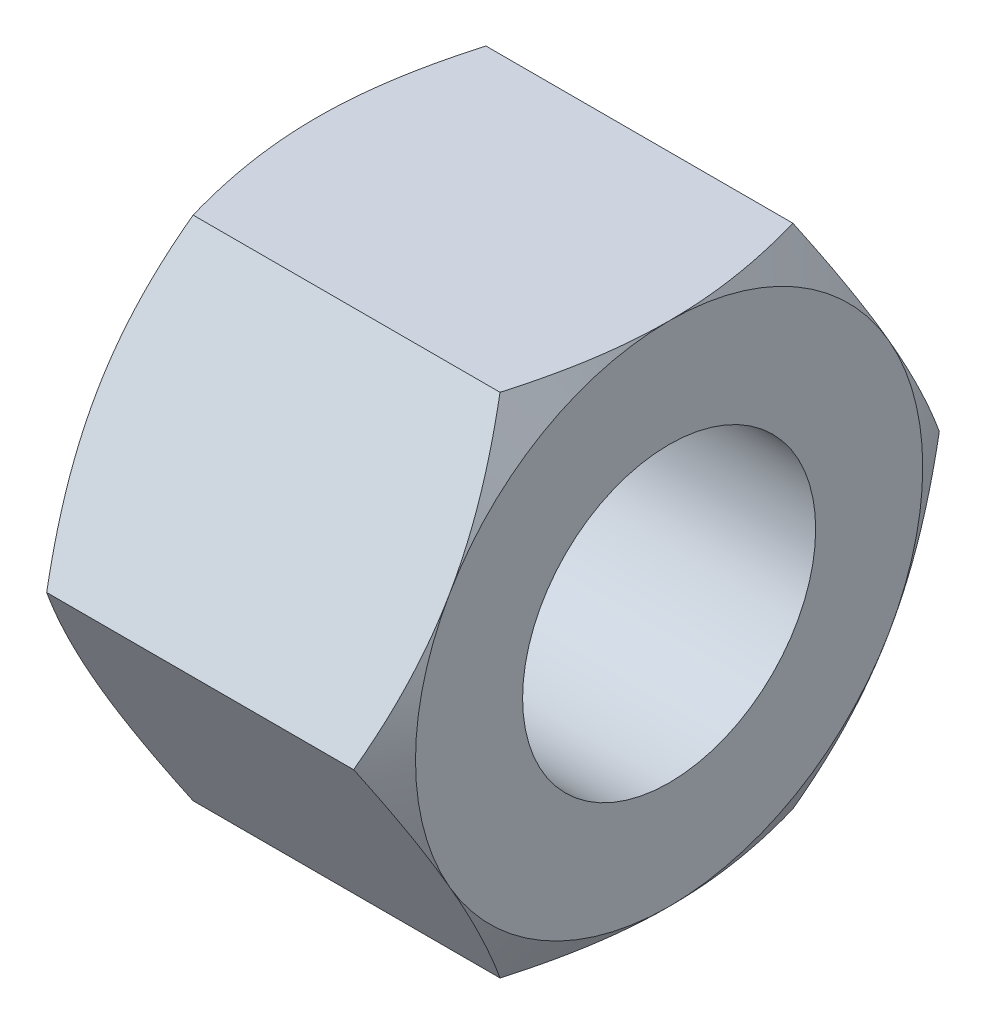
ISO-10303-21;
HEADER;
FILE_DESCRIPTION(('STEP AP214'),'2;1');
FILE_NAME('part.step','',(''),(''),'','','');
FILE_SCHEMA(('AUTOMOTIVE_DESIGN { 1 0 10303 214 1 1 1 1 }'));
ENDSEC;
DATA;
#1=APPLICATION_CONTEXT('core data for automotive mechanical design processes');
#2=APPLICATION_PROTOCOL_DEFINITION('international standard','automotive_design',2000,#1);
#3=PRODUCT_CONTEXT('',#1,'mechanical');
#4=PRODUCT('Part','Part','',(#3));
#5=PRODUCT_RELATED_PRODUCT_CATEGORY('part','',(#4));
#6=PRODUCT_DEFINITION_FORMATION('','',#4);
#7=PRODUCT_DEFINITION_CONTEXT('part definition',#1,'design');
#8=PRODUCT_DEFINITION('design','',#6,#7);
#9=PRODUCT_DEFINITION_SHAPE('','',#8);
#10=(LENGTH_UNIT() NAMED_UNIT(*) SI_UNIT(.MILLI.,.METRE.));
#11=(NAMED_UNIT(*) PLANE_ANGLE_UNIT() SI_UNIT($,.RADIAN.));
#12=(NAMED_UNIT(*) SI_UNIT($,.STERADIAN.) SOLID_ANGLE_UNIT());
#13=UNCERTAINTY_MEASURE_WITH_UNIT(LENGTH_MEASURE(1.E-05),#10,'distance_accuracy_value','');
#14=(GEOMETRIC_REPRESENTATION_CONTEXT(3) GLOBAL_UNCERTAINTY_ASSIGNED_CONTEXT((#13)) GLOBAL_UNIT_ASSIGNED_CONTEXT((#10,
#11,#12)) REPRESENTATION_CONTEXT('',''));
#15=CARTESIAN_POINT('',(0.,0.,0.));
#16=DIRECTION('',(0.,0.,1.));
#17=DIRECTION('',(1.,0.,0.));
#18=AXIS2_PLACEMENT_3D('',#15,#16,#17);
#19=CARTESIAN_POINT('',(0.,0.,0.));
#20=DIRECTION('',(-1.,0.,0.));
#21=DIRECTION('',(0.,0.,1.));
#22=AXIS2_PLACEMENT_3D('',#19,#20,#21);
#23=CONICAL_SURFACE('',#22,18.,1.0471975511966);
#24=CARTESIAN_POINT('',(-1.60776182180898,0.000199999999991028,-20.7847251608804));
#25=CARTESIAN_POINT('',(-1.47589336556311,-0.395432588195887,-20.5563065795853));
#26=CARTESIAN_POINT('',(-1.35000889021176,-0.792608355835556,-20.3269970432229));
#27=CARTESIAN_POINT('',(-1.11187123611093,-1.59014476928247,-19.8665391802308));
#28=CARTESIAN_POINT('',(-0.999622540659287,-1.99050641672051,-19.6353902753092));
#29=CARTESIAN_POINT('',(-0.790265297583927,-2.79518836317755,-19.1708069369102));
#30=CARTESIAN_POINT('',(-0.693192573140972,-3.19951570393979,-18.9373684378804));
#31=CARTESIAN_POINT('',(-0.516271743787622,-4.01097986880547,-18.4688693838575));
#32=CARTESIAN_POINT('',(-0.436422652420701,-4.41811653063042,-18.2338089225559));
#33=CARTESIAN_POINT('',(-0.297345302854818,-5.22476711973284,-17.7680889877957));
#34=CARTESIAN_POINT('',(-0.237656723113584,-5.62422116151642,-17.537464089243));
#35=CARTESIAN_POINT('',(-0.137572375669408,-6.42495960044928,-17.0751575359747));
#36=CARTESIAN_POINT('',(-0.0971769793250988,-6.82624403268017,-16.8434758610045));
#37=CARTESIAN_POINT('',(-0.0366989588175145,-7.62948698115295,-16.3797233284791));
#38=CARTESIAN_POINT('',(-0.016592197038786,-8.03144412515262,-16.1476532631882));
#39=CARTESIAN_POINT('',(0.0028761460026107,-8.83572943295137,-15.6832989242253));
#40=CARTESIAN_POINT('',(0.00223836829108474,-9.23805758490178,-15.4510146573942));
#41=CARTESIAN_POINT('',(-0.01833357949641,-9.99021934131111,-15.0167538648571));
#42=CARTESIAN_POINT('',(-0.0357591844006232,-10.3401065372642,-14.8147463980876));
#43=CARTESIAN_POINT('',(-0.0859690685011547,-11.0390463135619,-14.4112133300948));
#44=CARTESIAN_POINT('',(-0.118753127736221,-11.3880989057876,-14.209687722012));
#45=CARTESIAN_POINT('',(-0.199111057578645,-12.0852372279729,-13.8071947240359));
#46=CARTESIAN_POINT('',(-0.246698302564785,-12.4333217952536,-13.6062280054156));
#47=CARTESIAN_POINT('',(-0.355822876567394,-13.1278338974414,-13.2052512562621));
#48=CARTESIAN_POINT('',(-0.417360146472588,-13.4742614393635,-13.0052412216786));
#49=CARTESIAN_POINT('',(-0.624462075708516,-14.525886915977,-12.3980849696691));
#50=CARTESIAN_POINT('',(-0.790677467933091,-15.228039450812,-11.99269701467));
#51=CARTESIAN_POINT('',(-1.16791817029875,-16.6218747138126,-11.1879658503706));
#52=CARTESIAN_POINT('',(-1.37885488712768,-17.3135752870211,-10.78861233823));
#53=CARTESIAN_POINT('',(-1.60776182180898,-18.0002,-10.3921893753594));
#54=B_SPLINE_CURVE_WITH_KNOTS('',3,(#24,#25,#26,#27,#28,#29,#30,#31,#32,#33,#34,#35,#36,#37,#38,
#39,#40,#41,#42,#43,#44,#45,#46,#47,#48,#49,#50,#51,#52,#53),.UNSPECIFIED.,.F.,.F.,(4,2,2,2,2,2,
2,2,2,2,2,2,2,2,4),(0.,1.42650335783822,2.85347447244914,4.28376471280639,5.71397301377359,
7.10888071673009,8.50381526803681,9.89708828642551,11.2903182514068,12.5031974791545,
13.7160593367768,14.9300201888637,16.1439758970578,18.6253607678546,21.1018751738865),.UNSPECIFIED.);
#55=CARTESIAN_POINT('',(-1.60769515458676,0.,-20.7846096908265));
#56=VERTEX_POINT('',#55);
#57=CARTESIAN_POINT('',(0.,-8.99999999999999,-15.5884572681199));
#58=VERTEX_POINT('',#57);
#59=EDGE_CURVE('E360',#56,#58,#54,.T.);
#60=ORIENTED_EDGE('',*,*,#59,.F.);
#61=CARTESIAN_POINT('',(-1.60776182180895,18.0002,-10.3921893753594));
#62=CARTESIAN_POINT('',(-1.47589336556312,17.6045674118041,-10.6206079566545));
#63=CARTESIAN_POINT('',(-1.35000889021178,17.2073916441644,-10.8499174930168));
#64=CARTESIAN_POINT('',(-1.11187123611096,16.4098552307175,-11.3103753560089));
#65=CARTESIAN_POINT('',(-0.999622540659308,16.0094935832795,-11.5415242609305));
#66=CARTESIAN_POINT('',(-0.790265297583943,15.2048116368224,-12.0061075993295));
#67=CARTESIAN_POINT('',(-0.693192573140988,14.8004842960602,-12.2395460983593));
#68=CARTESIAN_POINT('',(-0.516271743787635,13.9890201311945,-12.7080451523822));
#69=CARTESIAN_POINT('',(-0.436422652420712,13.5818834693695,-12.9431056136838));
#70=CARTESIAN_POINT('',(-0.297345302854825,12.7752328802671,-13.4088255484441));
#71=CARTESIAN_POINT('',(-0.237656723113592,12.3757788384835,-13.6394504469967));
#72=CARTESIAN_POINT('',(-0.137572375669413,11.5750403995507,-14.1017570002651));
#73=CARTESIAN_POINT('',(-0.0971769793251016,11.1737559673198,-14.3334386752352));
#74=CARTESIAN_POINT('',(-0.0366989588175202,10.370513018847,-14.7971912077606));
#75=CARTESIAN_POINT('',(-0.0165921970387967,9.96855587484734,-15.0292612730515));
#76=CARTESIAN_POINT('',(0.00287614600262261,9.16427056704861,-15.4936156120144));
#77=CARTESIAN_POINT('',(0.00223836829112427,8.76194241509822,-15.7258998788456));
#78=CARTESIAN_POINT('',(-0.0183335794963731,8.00978065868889,-16.1601606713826));
#79=CARTESIAN_POINT('',(-0.0357591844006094,7.65989346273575,-16.3621681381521));
#80=CARTESIAN_POINT('',(-0.0859690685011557,6.96095368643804,-16.7657012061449));
#81=CARTESIAN_POINT('',(-0.118753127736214,6.61190109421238,-16.9672268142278));
#82=CARTESIAN_POINT('',(-0.199111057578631,5.91476277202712,-17.3697198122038));
#83=CARTESIAN_POINT('',(-0.246698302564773,5.56667820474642,-17.5706865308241));
#84=CARTESIAN_POINT('',(-0.355822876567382,4.87216610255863,-17.9716632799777));
#85=CARTESIAN_POINT('',(-0.417360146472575,4.52573856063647,-18.1716733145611));
#86=CARTESIAN_POINT('',(-0.624462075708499,3.47411308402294,-18.7788295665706));
#87=CARTESIAN_POINT('',(-0.790677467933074,2.77196054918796,-19.1842175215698));
#88=CARTESIAN_POINT('',(-1.16791817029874,1.37812528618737,-19.9889486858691));
#89=CARTESIAN_POINT('',(-1.37885488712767,0.686424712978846,-20.3883021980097));
#90=CARTESIAN_POINT('',(-1.60776182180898,-0.000200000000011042,-20.7847251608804));
#91=B_SPLINE_CURVE_WITH_KNOTS('',3,(#61,#62,#63,#64,#65,#66,#67,#68,#69,#70,#71,#72,#73,#74,#75,
#76,#77,#78,#79,#80,#81,#82,#83,#84,#85,#86,#87,#88,#89,#90),.UNSPECIFIED.,.F.,.F.,(4,2,2,2,2,2,
2,2,2,2,2,2,2,2,4),(0.,1.42650335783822,2.85347447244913,4.28376471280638,5.71397301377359,
7.10888071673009,8.50381526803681,9.8970882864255,11.2903182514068,12.5031974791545,
13.7160593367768,14.9300201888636,16.1439758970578,18.6253607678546,21.1018751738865),.UNSPECIFIED.);
#92=CARTESIAN_POINT('',(0.,9.,-15.5884572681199));
#93=VERTEX_POINT('',#92);
#94=EDGE_CURVE('E180',#93,#56,#91,.T.);
#95=ORIENTED_EDGE('',*,*,#94,.F.);
#96=CARTESIAN_POINT('',(0.,0.,0.));
#97=DIRECTION('',(-1.,0.,0.));
#98=DIRECTION('',(0.,0.,1.));
#99=AXIS2_PLACEMENT_3D('',#96,#97,#98);
#100=CIRCLE('',#99,18.);
#101=EDGE_CURVE('E305',#93,#58,#100,.T.);
#102=ORIENTED_EDGE('',*,*,#101,.T.);
#103=EDGE_LOOP('',(#60,#95,#102));
#104=FACE_BOUND('',#103,.T.);
#105=ADVANCED_FACE('F34',(#104),#23,.T.);
#106=CARTESIAN_POINT('',(-1.60769515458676,-18.,-10.3923048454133));
#107=VERTEX_POINT('',#106);
#108=EDGE_CURVE('E186',#58,#107,#54,.T.);
#109=ORIENTED_EDGE('',*,*,#108,.F.);
#110=CARTESIAN_POINT('',(0.,-18.,0.));
#111=VERTEX_POINT('',#110);
#112=EDGE_CURVE('E307',#58,#111,#100,.T.);
#113=ORIENTED_EDGE('',*,*,#112,.T.);
#114=CARTESIAN_POINT('',(-8.61350429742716,-18.,-27.5619727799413));
#115=CARTESIAN_POINT('',(-8.42250111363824,-18.,-27.1668363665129));
#116=CARTESIAN_POINT('',(-8.2324864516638,-18.,-26.7712223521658));
#117=CARTESIAN_POINT('',(-7.85466107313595,-18.,-25.9789382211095));
#118=CARTESIAN_POINT('',(-7.66685038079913,-18.,-25.5822680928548));
#119=CARTESIAN_POINT('',(-7.10701020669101,-18.,-24.3904060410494));
#120=CARTESIAN_POINT('',(-6.73863488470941,-18.,-23.5934908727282));
#121=CARTESIAN_POINT('',(-6.0118990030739,-18.,-21.9895934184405));
#122=CARTESIAN_POINT('',(-5.6536078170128,-18.,-21.1825796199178));
#123=CARTESIAN_POINT('',(-4.95240870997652,-18.,-19.5619199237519));
#124=CARTESIAN_POINT('',(-4.60949998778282,-18.,-18.7482743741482));
#125=CARTESIAN_POINT('',(-3.93909504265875,-18.,-17.1029564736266));
#126=CARTESIAN_POINT('',(-3.61183972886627,-18.,-16.2711854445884));
#127=CARTESIAN_POINT('',(-2.98295842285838,-18.,-14.5978268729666));
#128=CARTESIAN_POINT('',(-2.68133527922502,-18.,-13.7562382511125));
#129=CARTESIAN_POINT('',(-2.11182687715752,-18.,-12.0636618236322));
#130=CARTESIAN_POINT('',(-1.84386988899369,-18.,-11.2126983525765));
#131=CARTESIAN_POINT('',(-1.35038285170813,-18.,-9.49859158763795));
#132=CARTESIAN_POINT('',(-1.12483939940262,-18.,-8.63545223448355));
#133=CARTESIAN_POINT('',(-0.826590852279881,-18.,-7.33144727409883));
#134=CARTESIAN_POINT('',(-0.733837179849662,-18.,-6.8951370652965));
#135=CARTESIAN_POINT('',(-0.563150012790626,-18.,-6.01961274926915));
#136=CARTESIAN_POINT('',(-0.485216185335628,-18.,-5.58039870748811));
#137=CARTESIAN_POINT('',(-0.345550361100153,-18.,-4.69936149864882));
#138=CARTESIAN_POINT('',(-0.283819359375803,-18.,-4.25753817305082));
#139=CARTESIAN_POINT('',(-0.177799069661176,-18.,-3.37178866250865));
#140=CARTESIAN_POINT('',(-0.133509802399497,-18.,-2.92786247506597));
#141=CARTESIAN_POINT('',(-0.0635653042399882,-18.,-2.0413727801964));
#142=CARTESIAN_POINT('',(-0.0377934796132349,-18.,-1.5988185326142));
#143=CARTESIAN_POINT('',(-0.00501935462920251,-18.,-0.713017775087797));
#144=CARTESIAN_POINT('',(0.00198322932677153,-18.,-0.269771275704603));
#145=CARTESIAN_POINT('',(-0.00294720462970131,-18.,0.616495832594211));
#146=CARTESIAN_POINT('',(-0.0148749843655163,-18.,1.05951647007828));
#147=CARTESIAN_POINT('',(-0.0573695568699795,-18.,1.94466484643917));
#148=CARTESIAN_POINT('',(-0.0879371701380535,-18.,2.38679254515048));
#149=CARTESIAN_POINT('',(-0.183946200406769,-18.,3.45804884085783));
#150=CARTESIAN_POINT('',(-0.258707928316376,-18.,4.08635840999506));
#151=CARTESIAN_POINT('',(-0.441712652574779,-18.,5.33805549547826));
#152=CARTESIAN_POINT('',(-0.549960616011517,-18.,5.96144226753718));
#153=CARTESIAN_POINT('',(-0.919504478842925,-18.,7.82530592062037));
#154=CARTESIAN_POINT('',(-1.22535434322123,-18.,9.05705135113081));
#155=CARTESIAN_POINT('',(-1.75274123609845,-18.,10.8995368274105));
#156=CARTESIAN_POINT('',(-1.9425529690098,-18.,11.5199034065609));
#157=CARTESIAN_POINT('',(-2.34110156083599,-18.,12.7546432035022));
#158=CARTESIAN_POINT('',(-2.54984012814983,-18.,13.3690158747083));
#159=CARTESIAN_POINT('',(-2.98179468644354,-18.,14.5887054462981));
#160=CARTESIAN_POINT('',(-3.20492239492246,-18.,15.1940538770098));
#161=CARTESIAN_POINT('',(-3.54927449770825,-18.,16.0982639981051));
#162=CARTESIAN_POINT('',(-3.66564891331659,-18.,16.3989833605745));
#163=CARTESIAN_POINT('',(-3.90135657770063,-18.,16.9992538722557));
#164=CARTESIAN_POINT('',(-4.02068976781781,-18.,17.298805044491));
#165=CARTESIAN_POINT('',(-4.1413688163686,-18.,17.5978126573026));
#166=B_SPLINE_CURVE_WITH_KNOTS('',3,(#114,#115,#116,#117,#118,#119,#120,#121,#122,#123,#124,
#125,#126,#127,#128,#129,#130,#131,#132,#133,#134,#135,#136,#137,#138,#139,#140,#141,#142,#143,
#144,#145,#146,#147,#148,#149,#150,#151,#152,#153,#154,#155,#156,#157,#158,#159,#160,#161,#162,
#163,#164,#165),.UNSPECIFIED.,.F.,.F.,(4,2,2,2,2,2,2,2,2,2,2,2,2,2,2,2,2,2,2,2,2,2,2,2,2,4),(0.,
1.31663520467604,2.63328486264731,5.26701230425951,7.91581142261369,10.5644724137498,
13.2456515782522,15.9271283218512,18.6027913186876,21.277607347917,22.6155772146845,
23.9535170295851,25.2915389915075,26.629562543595,27.9590856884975,29.2885887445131,
30.6177239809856,31.9469177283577,33.8440654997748,35.7414948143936,39.5436623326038,
41.4897749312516,43.4360633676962,45.3713759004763,46.3387176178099,47.306040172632),.UNSPECIFIED.);
#167=EDGE_CURVE('E199',#107,#111,#166,.T.);
#168=ORIENTED_EDGE('',*,*,#167,.F.);
#169=EDGE_LOOP('',(#109,#113,#168));
#170=FACE_BOUND('',#169,.T.);
#171=ADVANCED_FACE('F165',(#170),#23,.T.);
#172=CARTESIAN_POINT('',(-1.60769515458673,-18.,10.3923048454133));
#173=VERTEX_POINT('',#172);
#174=EDGE_CURVE('E193',#111,#173,#166,.T.);
#175=ORIENTED_EDGE('',*,*,#174,.F.);
#176=CARTESIAN_POINT('',(0.,-8.99999999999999,15.5884572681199));
#177=VERTEX_POINT('',#176);
#178=EDGE_CURVE('E310',#111,#177,#100,.T.);
#179=ORIENTED_EDGE('',*,*,#178,.T.);
#180=CARTESIAN_POINT('',(-1.60776182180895,-18.0002,10.3921893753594));
#181=CARTESIAN_POINT('',(-1.47589336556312,-17.6045674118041,10.6206079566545));
#182=CARTESIAN_POINT('',(-1.35000889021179,-17.2073916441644,10.8499174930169));
#183=CARTESIAN_POINT('',(-1.11187123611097,-16.4098552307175,11.310375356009));
#184=CARTESIAN_POINT('',(-0.999622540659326,-16.0094935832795,11.5415242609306));
#185=CARTESIAN_POINT('',(-0.790265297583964,-15.2048116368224,12.0061075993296));
#186=CARTESIAN_POINT('',(-0.693192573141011,-14.8004842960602,12.2395460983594));
#187=CARTESIAN_POINT('',(-0.516271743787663,-13.9890201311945,12.7080451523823));
#188=CARTESIAN_POINT('',(-0.436422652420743,-13.5818834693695,12.9431056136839));
#189=CARTESIAN_POINT('',(-0.297345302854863,-12.7752328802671,13.4088255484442));
#190=CARTESIAN_POINT('',(-0.237656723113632,-12.3757788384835,13.6394504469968));
#191=CARTESIAN_POINT('',(-0.137572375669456,-11.5750403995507,14.1017570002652));
#192=CARTESIAN_POINT('',(-0.0971769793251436,-11.1737559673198,14.3334386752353));
#193=CARTESIAN_POINT('',(-0.0366989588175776,-10.370513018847,14.7971912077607));
#194=CARTESIAN_POINT('',(-0.0165921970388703,-9.96855587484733,15.0292612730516));
#195=CARTESIAN_POINT('',(0.00287614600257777,-9.16427056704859,15.4936156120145));
#196=CARTESIAN_POINT('',(0.00223836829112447,-8.7619424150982,15.7258998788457));
#197=CARTESIAN_POINT('',(-0.0183335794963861,-8.00978065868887,16.1601606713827));
#198=CARTESIAN_POINT('',(-0.0357591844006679,-7.65989346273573,16.3621681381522));
#199=CARTESIAN_POINT('',(-0.0859690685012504,-6.96095368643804,16.765701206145));
#200=CARTESIAN_POINT('',(-0.118753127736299,-6.61190109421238,16.9672268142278));
#201=CARTESIAN_POINT('',(-0.199111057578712,-5.91476277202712,17.3697198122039));
#202=CARTESIAN_POINT('',(-0.246698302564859,-5.56667820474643,17.5706865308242));
#203=CARTESIAN_POINT('',(-0.355822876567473,-4.87216610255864,17.9716632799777));
#204=CARTESIAN_POINT('',(-0.417360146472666,-4.52573856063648,18.1716733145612));
#205=CARTESIAN_POINT('',(-0.624462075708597,-3.47411308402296,18.7788295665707));
#206=CARTESIAN_POINT('',(-0.790677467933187,-2.77196054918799,19.1842175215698));
#207=CARTESIAN_POINT('',(-1.16791817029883,-1.37812528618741,19.9889486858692));
#208=CARTESIAN_POINT('',(-1.37885488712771,-0.686424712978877,20.3883021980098));
#209=CARTESIAN_POINT('',(-1.60776182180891,0.000199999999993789,20.7847251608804));
#210=B_SPLINE_CURVE_WITH_KNOTS('',3,(#180,#181,#182,#183,#184,#185,#186,#187,#188,#189,#190,
#191,#192,#193,#194,#195,#196,#197,#198,#199,#200,#201,#202,#203,#204,#205,#206,#207,#208,#209),
.UNSPECIFIED.,.F.,.F.,(4,2,2,2,2,2,2,2,2,2,2,2,2,2,4),(0.,1.42650335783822,2.85347447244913,
4.28376471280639,5.71397301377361,7.10888071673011,8.50381526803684,9.89708828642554,
11.2903182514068,12.5031974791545,13.7160593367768,14.9300201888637,16.1439758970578,
18.6253607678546,21.1018751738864),.UNSPECIFIED.);
#211=EDGE_CURVE('E267',#173,#177,#210,.T.);
#212=ORIENTED_EDGE('',*,*,#211,.F.);
#213=EDGE_LOOP('',(#175,#179,#212));
#214=FACE_BOUND('',#213,.T.);
#215=ADVANCED_FACE('F339',(#214),#23,.T.);
#216=CARTESIAN_POINT('',(-1.60769515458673,18.,-10.3923048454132));
#217=VERTEX_POINT('',#216);
#218=EDGE_CURVE('E228',#217,#93,#91,.T.);
#219=ORIENTED_EDGE('',*,*,#218,.F.);
#220=CARTESIAN_POINT('',(-8.61350429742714,18.,-27.5619727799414));
#221=CARTESIAN_POINT('',(-8.42250111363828,18.,-27.166836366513));
#222=CARTESIAN_POINT('',(-8.23248645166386,18.,-26.7712223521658));
#223=CARTESIAN_POINT('',(-7.85466107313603,18.,-25.9789382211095));
#224=CARTESIAN_POINT('',(-7.66685038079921,18.,-25.5822680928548));
#225=CARTESIAN_POINT('',(-7.10701020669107,18.,-24.3904060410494));
#226=CARTESIAN_POINT('',(-6.73863488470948,18.,-23.5934908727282));
#227=CARTESIAN_POINT('',(-6.01189900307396,18.,-21.9895934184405));
#228=CARTESIAN_POINT('',(-5.65360781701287,18.,-21.1825796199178));
#229=CARTESIAN_POINT('',(-4.95240870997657,18.,-19.5619199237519));
#230=CARTESIAN_POINT('',(-4.60949998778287,18.,-18.7482743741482));
#231=CARTESIAN_POINT('',(-3.9390950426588,18.,-17.1029564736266));
#232=CARTESIAN_POINT('',(-3.61183972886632,18.,-16.2711854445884));
#233=CARTESIAN_POINT('',(-2.98295842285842,18.,-14.5978268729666));
#234=CARTESIAN_POINT('',(-2.68133527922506,18.,-13.7562382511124));
#235=CARTESIAN_POINT('',(-2.11182687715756,18.,-12.0636618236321));
#236=CARTESIAN_POINT('',(-1.84386988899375,18.,-11.2126983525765));
#237=CARTESIAN_POINT('',(-1.35038285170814,18.,-9.4985915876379));
#238=CARTESIAN_POINT('',(-1.12483939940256,18.,-8.63545223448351));
#239=CARTESIAN_POINT('',(-0.826590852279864,18.,-7.33144727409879));
#240=CARTESIAN_POINT('',(-0.733837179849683,18.,-6.89513706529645));
#241=CARTESIAN_POINT('',(-0.563150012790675,18.,-6.01961274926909));
#242=CARTESIAN_POINT('',(-0.485216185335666,18.,-5.58039870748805));
#243=CARTESIAN_POINT('',(-0.345550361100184,18.,-4.69936149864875));
#244=CARTESIAN_POINT('',(-0.283819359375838,18.,-4.25753817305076));
#245=CARTESIAN_POINT('',(-0.177799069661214,18.,-3.37178866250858));
#246=CARTESIAN_POINT('',(-0.133509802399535,18.,-2.9278624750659));
#247=CARTESIAN_POINT('',(-0.0635653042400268,18.,-2.04137278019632));
#248=CARTESIAN_POINT('',(-0.0377934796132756,18.,-1.59881853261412));
#249=CARTESIAN_POINT('',(-0.00501935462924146,18.,-0.713017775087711));
#250=CARTESIAN_POINT('',(0.00198322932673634,18.,-0.269771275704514));
#251=CARTESIAN_POINT('',(-0.00294720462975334,18.,0.616495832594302));
#252=CARTESIAN_POINT('',(-0.0148749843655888,18.,1.05951647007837));
#253=CARTESIAN_POINT('',(-0.0573695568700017,18.,1.94466484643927));
#254=CARTESIAN_POINT('',(-0.0879371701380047,18.,2.38679254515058));
#255=CARTESIAN_POINT('',(-0.183946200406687,18.,3.45804884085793));
#256=CARTESIAN_POINT('',(-0.258707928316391,18.,4.08635840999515));
#257=CARTESIAN_POINT('',(-0.441712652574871,18.,5.33805549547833));
#258=CARTESIAN_POINT('',(-0.549960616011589,18.,5.96144226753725));
#259=CARTESIAN_POINT('',(-0.919504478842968,18.,7.82530592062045));
#260=CARTESIAN_POINT('',(-1.2253543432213,18.,9.05705135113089));
#261=CARTESIAN_POINT('',(-1.75274123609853,18.,10.8995368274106));
#262=CARTESIAN_POINT('',(-1.94255296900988,18.,11.519903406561));
#263=CARTESIAN_POINT('',(-2.34110156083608,18.,12.7546432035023));
#264=CARTESIAN_POINT('',(-2.54984012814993,18.,13.3690158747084));
#265=CARTESIAN_POINT('',(-2.98179468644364,18.,14.5887054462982));
#266=CARTESIAN_POINT('',(-3.20492239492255,18.,15.1940538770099));
#267=CARTESIAN_POINT('',(-3.54927449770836,18.,16.0982639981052));
#268=CARTESIAN_POINT('',(-3.66564891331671,18.,16.3989833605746));
#269=CARTESIAN_POINT('',(-3.90135657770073,18.,16.9992538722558));
#270=CARTESIAN_POINT('',(-4.02068976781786,18.,17.2988050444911));
#271=CARTESIAN_POINT('',(-4.14136881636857,18.,17.5978126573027));
#272=B_SPLINE_CURVE_WITH_KNOTS('',3,(#220,#221,#222,#223,#224,#225,#226,#227,#228,#229,#230,
#231,#232,#233,#234,#235,#236,#237,#238,#239,#240,#241,#242,#243,#244,#245,#246,#247,#248,#249,
#250,#251,#252,#253,#254,#255,#256,#257,#258,#259,#260,#261,#262,#263,#264,#265,#266,#267,#268,
#269,#270,#271),.UNSPECIFIED.,.F.,.F.,(4,2,2,2,2,2,2,2,2,2,2,2,2,2,2,2,2,2,2,2,2,2,2,2,2,4),(0.,
1.31663520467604,2.63328486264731,5.26701230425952,7.91581142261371,10.5644724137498,
13.2456515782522,15.9271283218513,18.6027913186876,21.277607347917,22.6155772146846,
23.9535170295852,25.2915389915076,26.629562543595,27.9590856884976,29.2885887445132,
30.6177239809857,31.9469177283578,33.8440654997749,35.7414948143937,39.5436623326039,
41.4897749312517,43.4360633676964,45.3713759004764,46.33871761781,47.3060401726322),.UNSPECIFIED.);
#273=CARTESIAN_POINT('',(0.,18.,0.));
#274=VERTEX_POINT('',#273);
#275=EDGE_CURVE('E142',#274,#217,#272,.F.);
#276=ORIENTED_EDGE('',*,*,#275,.F.);
#277=EDGE_CURVE('E42',#274,#93,#100,.T.);
#278=ORIENTED_EDGE('',*,*,#277,.T.);
#279=EDGE_LOOP('',(#219,#276,#278));
#280=FACE_BOUND('',#279,.T.);
#281=ADVANCED_FACE('F337',(#280),#23,.T.);
#282=CARTESIAN_POINT('',(-1.6076951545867,0.,20.7846096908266));
#283=VERTEX_POINT('',#282);
#284=EDGE_CURVE('E268',#177,#283,#210,.T.);
#285=ORIENTED_EDGE('',*,*,#284,.F.);
#286=CARTESIAN_POINT('',(0.,9.00000000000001,15.58845726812));
#287=VERTEX_POINT('',#286);
#288=EDGE_CURVE('E43',#177,#287,#100,.T.);
#289=ORIENTED_EDGE('',*,*,#288,.T.);
#290=CARTESIAN_POINT('',(-1.60776182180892,-0.000200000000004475,20.7847251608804));
#291=CARTESIAN_POINT('',(-1.47589336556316,0.395432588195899,20.5563065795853));
#292=CARTESIAN_POINT('',(-1.35000889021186,0.792608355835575,20.326997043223));
#293=CARTESIAN_POINT('',(-1.11187123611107,1.59014476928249,19.8665391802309));
#294=CARTESIAN_POINT('',(-0.999622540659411,1.99050641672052,19.6353902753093));
#295=CARTESIAN_POINT('',(-0.790265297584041,2.79518836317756,19.1708069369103));
#296=CARTESIAN_POINT('',(-0.693192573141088,3.1995157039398,18.9373684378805));
#297=CARTESIAN_POINT('',(-0.516271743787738,4.01097986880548,18.4688693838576));
#298=CARTESIAN_POINT('',(-0.436422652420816,4.41811653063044,18.233808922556));
#299=CARTESIAN_POINT('',(-0.297345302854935,5.22476711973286,17.7680889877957));
#300=CARTESIAN_POINT('',(-0.237656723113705,5.62422116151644,17.5374640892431));
#301=CARTESIAN_POINT('',(-0.137572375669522,6.42495960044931,17.0751575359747));
#302=CARTESIAN_POINT('',(-0.0971769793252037,6.82624403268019,16.8434758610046));
#303=CARTESIAN_POINT('',(-0.0366989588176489,7.62948698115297,16.3797233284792));
#304=CARTESIAN_POINT('',(-0.0165921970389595,8.03144412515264,16.1476532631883));
#305=CARTESIAN_POINT('',(0.00287614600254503,8.83572943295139,15.6832989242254));
#306=CARTESIAN_POINT('',(0.00223836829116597,9.2380575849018,15.4510146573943));
#307=CARTESIAN_POINT('',(-0.0183335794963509,9.99021934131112,15.0167538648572));
#308=CARTESIAN_POINT('',(-0.0357591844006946,10.3401065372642,14.8147463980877));
#309=CARTESIAN_POINT('',(-0.0859690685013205,11.0390463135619,14.4112133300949));
#310=CARTESIAN_POINT('',(-0.118753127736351,11.3880989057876,14.2096877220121));
#311=CARTESIAN_POINT('',(-0.199111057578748,12.0852372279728,13.807194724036));
#312=CARTESIAN_POINT('',(-0.246698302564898,12.4333217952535,13.6062280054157));
#313=CARTESIAN_POINT('',(-0.355822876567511,13.1278338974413,13.2052512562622));
#314=CARTESIAN_POINT('',(-0.4173601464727,13.4742614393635,13.0052412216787));
#315=CARTESIAN_POINT('',(-0.624462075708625,14.525886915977,12.3980849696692));
#316=CARTESIAN_POINT('',(-0.790677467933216,15.228039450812,11.9926970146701));
#317=CARTESIAN_POINT('',(-1.16791817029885,16.6218747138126,11.1879658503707));
#318=CARTESIAN_POINT('',(-1.37885488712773,17.3135752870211,10.7886123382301));
#319=CARTESIAN_POINT('',(-1.60776182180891,18.0002,10.3921893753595));
#320=B_SPLINE_CURVE_WITH_KNOTS('',3,(#290,#291,#292,#293,#294,#295,#296,#297,#298,#299,#300,
#301,#302,#303,#304,#305,#306,#307,#308,#309,#310,#311,#312,#313,#314,#315,#316,#317,#318,#319),
.UNSPECIFIED.,.F.,.F.,(4,2,2,2,2,2,2,2,2,2,2,2,2,2,4),(0.,1.4265033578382,2.85347447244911,
4.28376471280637,5.71397301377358,7.10888071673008,8.50381526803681,9.89708828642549,
11.2903182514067,12.5031974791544,13.7160593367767,14.9300201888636,16.1439758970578,
18.6253607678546,21.1018751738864),.UNSPECIFIED.);
#321=EDGE_CURVE('E50',#283,#287,#320,.T.);
#322=ORIENTED_EDGE('',*,*,#321,.F.);
#323=EDGE_LOOP('',(#285,#289,#322));
#324=FACE_BOUND('',#323,.T.);
#325=ADVANCED_FACE('F319',(#324),#23,.T.);
#326=CARTESIAN_POINT('',(-1.60769515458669,18.,10.3923048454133));
#327=VERTEX_POINT('',#326);
#328=EDGE_CURVE('E132',#327,#274,#272,.F.);
#329=ORIENTED_EDGE('',*,*,#328,.F.);
#330=EDGE_CURVE('E122',#287,#327,#320,.T.);
#331=ORIENTED_EDGE('',*,*,#330,.F.);
#332=EDGE_CURVE('E13',#287,#274,#100,.T.);
#333=ORIENTED_EDGE('',*,*,#332,.T.);
#334=EDGE_LOOP('',(#329,#331,#333));
#335=FACE_BOUND('',#334,.T.);
#336=ADVANCED_FACE('F139',(#335),#23,.T.);
#337=CARTESIAN_POINT('',(-23.3919528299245,0.,0.));
#338=DIRECTION('',(1.,0.,0.));
#339=DIRECTION('',(0.,0.,-1.));
#340=AXIS2_PLACEMENT_3D('',#337,#338,#339);
#341=CONICAL_SURFACE('',#340,20.7852193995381,1.04719755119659);
#342=CARTESIAN_POINT('',(-23.392238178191,0.000199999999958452,20.7847251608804));
#343=CARTESIAN_POINT('',(-23.5241066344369,-0.395432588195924,20.5563065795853));
#344=CARTESIAN_POINT('',(-23.6499911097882,-0.792608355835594,20.3269970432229));
#345=CARTESIAN_POINT('',(-23.888128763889,-1.5901447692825,19.8665391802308));
#346=CARTESIAN_POINT('',(-24.0003774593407,-1.99050641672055,19.6353902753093));
#347=CARTESIAN_POINT('',(-24.209734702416,-2.79518836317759,19.1708069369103));
#348=CARTESIAN_POINT('',(-24.306807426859,-3.19951570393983,18.9373684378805));
#349=CARTESIAN_POINT('',(-24.4837282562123,-4.01097986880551,18.4688693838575));
#350=CARTESIAN_POINT('',(-24.5635773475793,-4.41811653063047,18.2338089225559));
#351=CARTESIAN_POINT('',(-24.7026546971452,-5.22476711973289,17.7680889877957));
#352=CARTESIAN_POINT('',(-24.7623432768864,-5.62422116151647,17.537464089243));
#353=CARTESIAN_POINT('',(-24.8624276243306,-6.42495960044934,17.0751575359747));
#354=CARTESIAN_POINT('',(-24.9028230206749,-6.82624403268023,16.8434758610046));
#355=CARTESIAN_POINT('',(-24.9633010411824,-7.62948698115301,16.3797233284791));
#356=CARTESIAN_POINT('',(-24.9834078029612,-8.03144412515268,16.1476532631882));
#357=CARTESIAN_POINT('',(-25.0028761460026,-8.83572943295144,15.6832989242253));
#358=CARTESIAN_POINT('',(-25.0022383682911,-9.23805758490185,15.4510146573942));
#359=CARTESIAN_POINT('',(-24.9816664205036,-9.99021934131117,15.0167538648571));
#360=CARTESIAN_POINT('',(-24.9642408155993,-10.3401065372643,14.8147463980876));
#361=CARTESIAN_POINT('',(-24.9140309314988,-11.039046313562,14.4112133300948));
#362=CARTESIAN_POINT('',(-24.8812468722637,-11.3880989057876,14.209687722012));
#363=CARTESIAN_POINT('',(-24.8008889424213,-12.0852372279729,13.8071947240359));
#364=CARTESIAN_POINT('',(-24.7533016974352,-12.4333217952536,13.6062280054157));
#365=CARTESIAN_POINT('',(-24.6441771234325,-13.1278338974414,13.2052512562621));
#366=CARTESIAN_POINT('',(-24.5826398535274,-13.4742614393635,13.0052412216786));
#367=CARTESIAN_POINT('',(-24.3755379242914,-14.5258869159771,12.3980849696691));
#368=CARTESIAN_POINT('',(-24.2093225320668,-15.228039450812,11.99269701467));
#369=CARTESIAN_POINT('',(-23.8320818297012,-16.6218747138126,11.1879658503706));
#370=CARTESIAN_POINT('',(-23.6211451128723,-17.3135752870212,10.78861233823));
#371=CARTESIAN_POINT('',(-23.392238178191,-18.0002,10.3921893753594));
#372=B_SPLINE_CURVE_WITH_KNOTS('',3,(#342,#343,#344,#345,#346,#347,#348,#349,#350,#351,#352,
#353,#354,#355,#356,#357,#358,#359,#360,#361,#362,#363,#364,#365,#366,#367,#368,#369,#370,#371),
.UNSPECIFIED.,.F.,.F.,(4,2,2,2,2,2,2,2,2,2,2,2,2,2,4),(0.,1.42650335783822,2.85347447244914,
4.28376471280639,5.71397301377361,7.10888071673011,8.50381526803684,9.89708828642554,
11.2903182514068,12.5031974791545,13.7160593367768,14.9300201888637,16.1439758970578,
18.6253607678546,21.1018751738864),.UNSPECIFIED.);
#373=CARTESIAN_POINT('',(-23.3923048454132,0.,20.7846096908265));
#374=VERTEX_POINT('',#373);
#375=CARTESIAN_POINT('',(-25.,-9.00000000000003,15.5884572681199));
#376=VERTEX_POINT('',#375);
#377=EDGE_CURVE('E272',#374,#376,#372,.T.);
#378=ORIENTED_EDGE('',*,*,#377,.F.);
#379=CARTESIAN_POINT('',(-23.392238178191,18.0002,10.3921893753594));
#380=CARTESIAN_POINT('',(-23.5241066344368,17.6045674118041,10.6206079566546));
#381=CARTESIAN_POINT('',(-23.6499911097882,17.2073916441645,10.849917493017));
#382=CARTESIAN_POINT('',(-23.888128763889,16.4098552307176,11.3103753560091));
#383=CARTESIAN_POINT('',(-24.0003774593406,16.0094935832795,11.5415242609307));
#384=CARTESIAN_POINT('',(-24.209734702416,15.2048116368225,12.0061075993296));
#385=CARTESIAN_POINT('',(-24.3068074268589,14.8004842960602,12.2395460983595));
#386=CARTESIAN_POINT('',(-24.4837282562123,13.9890201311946,12.7080451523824));
#387=CARTESIAN_POINT('',(-24.5635773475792,13.5818834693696,12.943105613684));
#388=CARTESIAN_POINT('',(-24.7026546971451,12.7752328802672,13.4088255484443));
#389=CARTESIAN_POINT('',(-24.7623432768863,12.3757788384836,13.6394504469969));
#390=CARTESIAN_POINT('',(-24.8624276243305,11.5750403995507,14.1017570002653));
#391=CARTESIAN_POINT('',(-24.9028230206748,11.1737559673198,14.3334386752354));
#392=CARTESIAN_POINT('',(-24.9633010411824,10.3705130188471,14.7971912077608));
#393=CARTESIAN_POINT('',(-24.9834078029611,9.96855587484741,15.0292612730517));
#394=CARTESIAN_POINT('',(-25.0028761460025,9.16427056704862,15.4936156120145));
#395=CARTESIAN_POINT('',(-25.0022383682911,8.76194241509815,15.7258998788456));
#396=CARTESIAN_POINT('',(-24.9816664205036,8.00978065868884,16.1601606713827));
#397=CARTESIAN_POINT('',(-24.9642408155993,7.65989346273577,16.3621681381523));
#398=CARTESIAN_POINT('',(-24.9140309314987,6.96095368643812,16.7657012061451));
#399=CARTESIAN_POINT('',(-24.8812468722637,6.61190109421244,16.9672268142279));
#400=CARTESIAN_POINT('',(-24.8008889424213,5.91476277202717,17.369719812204));
#401=CARTESIAN_POINT('',(-24.7533016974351,5.56667820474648,17.5706865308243));
#402=CARTESIAN_POINT('',(-24.6441771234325,4.87216610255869,17.9716632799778));
#403=CARTESIAN_POINT('',(-24.5826398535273,4.52573856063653,18.1716733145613));
#404=CARTESIAN_POINT('',(-24.3755379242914,3.47411308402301,18.7788295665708));
#405=CARTESIAN_POINT('',(-24.2093225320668,2.77196054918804,19.1842175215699));
#406=CARTESIAN_POINT('',(-23.8320818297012,1.37812528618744,19.9889486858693));
#407=CARTESIAN_POINT('',(-23.6211451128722,0.686424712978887,20.3883021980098));
#408=CARTESIAN_POINT('',(-23.392238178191,-0.000200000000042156,20.7847251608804));
#409=B_SPLINE_CURVE_WITH_KNOTS('',3,(#379,#380,#381,#382,#383,#384,#385,#386,#387,#388,#389,
#390,#391,#392,#393,#394,#395,#396,#397,#398,#399,#400,#401,#402,#403,#404,#405,#406,#407,#408),
.UNSPECIFIED.,.F.,.F.,(4,2,2,2,2,2,2,2,2,2,2,2,2,2,4),(0.,1.42650335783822,2.85347447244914,
4.28376471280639,5.7139730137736,7.1088807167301,8.50381526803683,9.89708828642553,
11.2903182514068,12.5031974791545,13.7160593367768,14.9300201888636,16.1439758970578,
18.6253607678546,21.1018751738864),.UNSPECIFIED.);
#410=CARTESIAN_POINT('',(-25.,8.99999999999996,15.5884572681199));
#411=VERTEX_POINT('',#410);
#412=EDGE_CURVE('E323',#411,#374,#409,.T.);
#413=ORIENTED_EDGE('',*,*,#412,.F.);
#414=CARTESIAN_POINT('',(-25.,0.,0.));
#415=DIRECTION('',(-1.,0.,0.));
#416=DIRECTION('',(0.,0.,1.));
#417=AXIS2_PLACEMENT_3D('',#414,#415,#416);
#418=CIRCLE('',#417,18.);
#419=EDGE_CURVE('E260',#376,#411,#418,.T.);
#420=ORIENTED_EDGE('',*,*,#419,.F.);
#421=EDGE_LOOP('',(#378,#413,#420));
#422=FACE_BOUND('',#421,.T.);
#423=ADVANCED_FACE('F167',(#422),#341,.T.);
#424=CARTESIAN_POINT('',(-23.3923048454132,-18.,10.3923048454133));
#425=VERTEX_POINT('',#424);
#426=EDGE_CURVE('E205',#376,#425,#372,.T.);
#427=ORIENTED_EDGE('',*,*,#426,.F.);
#428=CARTESIAN_POINT('',(-25.,-18.0000000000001,0.));
#429=VERTEX_POINT('',#428);
#430=EDGE_CURVE('E354',#429,#376,#418,.T.);
#431=ORIENTED_EDGE('',*,*,#430,.F.);
#432=CARTESIAN_POINT('',(-16.3864957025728,-18.,-27.5619727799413));
#433=CARTESIAN_POINT('',(-16.5774988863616,-18.,-27.1668363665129));
#434=CARTESIAN_POINT('',(-16.767513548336,-18.,-26.7712223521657));
#435=CARTESIAN_POINT('',(-17.1453389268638,-18.,-25.9789382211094));
#436=CARTESIAN_POINT('',(-17.3331496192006,-18.,-25.5822680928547));
#437=CARTESIAN_POINT('',(-17.8929897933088,-18.,-24.3904060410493));
#438=CARTESIAN_POINT('',(-18.2613651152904,-18.,-23.5934908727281));
#439=CARTESIAN_POINT('',(-18.9881009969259,-18.,-21.9895934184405));
#440=CARTESIAN_POINT('',(-19.346392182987,-18.,-21.1825796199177));
#441=CARTESIAN_POINT('',(-20.0475912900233,-18.,-19.5619199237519));
#442=CARTESIAN_POINT('',(-20.390500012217,-18.,-18.7482743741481));
#443=CARTESIAN_POINT('',(-21.0609049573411,-18.,-17.1029564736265));
#444=CARTESIAN_POINT('',(-21.3881602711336,-18.,-16.2711854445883));
#445=CARTESIAN_POINT('',(-22.0170415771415,-18.,-14.5978268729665));
#446=CARTESIAN_POINT('',(-22.3186647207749,-18.,-13.7562382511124));
#447=CARTESIAN_POINT('',(-22.8881731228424,-18.,-12.0636618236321));
#448=CARTESIAN_POINT('',(-23.1561301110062,-18.,-11.2126983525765));
#449=CARTESIAN_POINT('',(-23.6496171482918,-18.,-9.49859158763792));
#450=CARTESIAN_POINT('',(-23.8751606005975,-18.,-8.63545223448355));
#451=CARTESIAN_POINT('',(-24.1734091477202,-18.,-7.33144727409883));
#452=CARTESIAN_POINT('',(-24.2661628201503,-18.,-6.89513706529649));
#453=CARTESIAN_POINT('',(-24.4368499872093,-18.,-6.01961274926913));
#454=CARTESIAN_POINT('',(-24.5147838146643,-18.,-5.5803987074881));
#455=CARTESIAN_POINT('',(-24.6544496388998,-18.,-4.6993614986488));
#456=CARTESIAN_POINT('',(-24.7161806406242,-18.,-4.25753817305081));
#457=CARTESIAN_POINT('',(-24.8222009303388,-18.,-3.37178866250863));
#458=CARTESIAN_POINT('',(-24.8664901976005,-18.,-2.92786247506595));
#459=CARTESIAN_POINT('',(-24.93643469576,-18.,-2.04137278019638));
#460=CARTESIAN_POINT('',(-24.9622065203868,-18.,-1.59881853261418));
#461=CARTESIAN_POINT('',(-24.9949806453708,-18.,-0.713017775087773));
#462=CARTESIAN_POINT('',(-25.0019832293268,-18.,-0.269771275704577));
#463=CARTESIAN_POINT('',(-24.9970527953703,-18.,0.616495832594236));
#464=CARTESIAN_POINT('',(-24.9851250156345,-18.,1.0595164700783));
#465=CARTESIAN_POINT('',(-24.94263044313,-18.,1.9446648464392));
#466=CARTESIAN_POINT('',(-24.912062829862,-18.0000000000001,2.38679254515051));
#467=CARTESIAN_POINT('',(-24.8160537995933,-18.0000000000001,3.45804884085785));
#468=CARTESIAN_POINT('',(-24.7412920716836,-18.,4.08635840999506));
#469=CARTESIAN_POINT('',(-24.5582873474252,-18.,5.33805549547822));
#470=CARTESIAN_POINT('',(-24.4500393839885,-18.,5.96144226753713));
#471=CARTESIAN_POINT('',(-24.0804955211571,-18.,7.82530592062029));
#472=CARTESIAN_POINT('',(-23.7746456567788,-18.,9.0570513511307));
#473=CARTESIAN_POINT('',(-23.2472587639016,-18.,10.8995368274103));
#474=CARTESIAN_POINT('',(-23.0574470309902,-18.,11.5199034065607));
#475=CARTESIAN_POINT('',(-22.658898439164,-18.,12.754643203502));
#476=CARTESIAN_POINT('',(-22.4501598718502,-18.,13.3690158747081));
#477=CARTESIAN_POINT('',(-22.0182053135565,-18.,14.5887054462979));
#478=CARTESIAN_POINT('',(-21.7950776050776,-18.,15.1940538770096));
#479=CARTESIAN_POINT('',(-21.4507255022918,-18.,16.0982639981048));
#480=CARTESIAN_POINT('',(-21.3343510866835,-18.,16.3989833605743));
#481=CARTESIAN_POINT('',(-21.0986434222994,-18.,16.9992538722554));
#482=CARTESIAN_POINT('',(-20.9793102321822,-18.,17.2988050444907));
#483=CARTESIAN_POINT('',(-20.8586311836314,-18.,17.5978126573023));
#484=B_SPLINE_CURVE_WITH_KNOTS('',3,(#432,#433,#434,#435,#436,#437,#438,#439,#440,#441,#442,
#443,#444,#445,#446,#447,#448,#449,#450,#451,#452,#453,#454,#455,#456,#457,#458,#459,#460,#461,
#462,#463,#464,#465,#466,#467,#468,#469,#470,#471,#472,#473,#474,#475,#476,#477,#478,#479,#480,
#481,#482,#483),.UNSPECIFIED.,.F.,.F.,(4,2,2,2,2,2,2,2,2,2,2,2,2,2,2,2,2,2,2,2,2,2,2,2,2,4),(0.,
1.31663520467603,2.6332848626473,5.26701230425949,7.91581142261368,10.5644724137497,
13.2456515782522,15.9271283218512,18.6027913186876,21.277607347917,22.6155772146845,
23.9535170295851,25.2915389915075,26.629562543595,27.9590856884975,29.2885887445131,
30.6177239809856,31.9469177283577,33.8440654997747,35.7414948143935,39.5436623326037,
41.4897749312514,43.436063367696,45.371375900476,46.3387176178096,47.3060401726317),.UNSPECIFIED.);
#485=EDGE_CURVE('E200',#425,#429,#484,.F.);
#486=ORIENTED_EDGE('',*,*,#485,.F.);
#487=EDGE_LOOP('',(#427,#431,#486));
#488=FACE_BOUND('',#487,.T.);
#489=ADVANCED_FACE('F352',(#488),#341,.T.);
#490=CARTESIAN_POINT('',(-23.3923048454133,-18.0000000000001,-10.3923048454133));
#491=VERTEX_POINT('',#490);
#492=EDGE_CURVE('E201',#429,#491,#484,.F.);
#493=ORIENTED_EDGE('',*,*,#492,.F.);
#494=CARTESIAN_POINT('',(-25.,-9.00000000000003,-15.5884572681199));
#495=VERTEX_POINT('',#494);
#496=EDGE_CURVE('E255',#495,#429,#418,.T.);
#497=ORIENTED_EDGE('',*,*,#496,.F.);
#498=CARTESIAN_POINT('',(-23.3922381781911,-18.0002000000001,-10.3921893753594));
#499=CARTESIAN_POINT('',(-23.5241066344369,-17.6045674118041,-10.6206079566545));
#500=CARTESIAN_POINT('',(-23.6499911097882,-17.2073916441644,-10.8499174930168));
#501=CARTESIAN_POINT('',(-23.888128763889,-16.4098552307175,-11.3103753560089));
#502=CARTESIAN_POINT('',(-24.0003774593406,-16.0094935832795,-11.5415242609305));
#503=CARTESIAN_POINT('',(-24.209734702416,-15.2048116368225,-12.0061075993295));
#504=CARTESIAN_POINT('',(-24.306807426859,-14.8004842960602,-12.2395460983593));
#505=CARTESIAN_POINT('',(-24.4837282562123,-13.9890201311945,-12.7080451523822));
#506=CARTESIAN_POINT('',(-24.5635773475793,-13.5818834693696,-12.9431056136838));
#507=CARTESIAN_POINT('',(-24.7026546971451,-12.7752328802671,-13.4088255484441));
#508=CARTESIAN_POINT('',(-24.7623432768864,-12.3757788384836,-13.6394504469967));
#509=CARTESIAN_POINT('',(-24.8624276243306,-11.5750403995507,-14.1017570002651));
#510=CARTESIAN_POINT('',(-24.9028230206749,-11.1737559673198,-14.3334386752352));
#511=CARTESIAN_POINT('',(-24.9633010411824,-10.370513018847,-14.7971912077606));
#512=CARTESIAN_POINT('',(-24.9834078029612,-9.96855587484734,-15.0292612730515));
#513=CARTESIAN_POINT('',(-25.0028761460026,-9.16427056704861,-15.4936156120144));
#514=CARTESIAN_POINT('',(-25.0022383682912,-8.76194241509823,-15.7258998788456));
#515=CARTESIAN_POINT('',(-24.9816664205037,-8.0097806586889,-16.1601606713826));
#516=CARTESIAN_POINT('',(-24.9642408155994,-7.65989346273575,-16.3621681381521));
#517=CARTESIAN_POINT('',(-24.9140309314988,-6.96095368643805,-16.7657012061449));
#518=CARTESIAN_POINT('',(-24.8812468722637,-6.6119010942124,-16.9672268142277));
#519=CARTESIAN_POINT('',(-24.8008889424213,-5.91476277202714,-17.3697198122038));
#520=CARTESIAN_POINT('',(-24.7533016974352,-5.56667820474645,-17.5706865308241));
#521=CARTESIAN_POINT('',(-24.6441771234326,-4.87216610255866,-17.9716632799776));
#522=CARTESIAN_POINT('',(-24.5826398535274,-4.5257385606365,-18.1716733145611));
#523=CARTESIAN_POINT('',(-24.3755379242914,-3.47411308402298,-18.7788295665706));
#524=CARTESIAN_POINT('',(-24.2093225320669,-2.77196054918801,-19.1842175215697));
#525=CARTESIAN_POINT('',(-23.8320818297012,-1.37812528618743,-19.9889486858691));
#526=CARTESIAN_POINT('',(-23.6211451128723,-0.686424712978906,-20.3883021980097));
#527=CARTESIAN_POINT('',(-23.3922381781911,0.000199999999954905,-20.7847251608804));
#528=B_SPLINE_CURVE_WITH_KNOTS('',3,(#498,#499,#500,#501,#502,#503,#504,#505,#506,#507,#508,
#509,#510,#511,#512,#513,#514,#515,#516,#517,#518,#519,#520,#521,#522,#523,#524,#525,#526,#527),
.UNSPECIFIED.,.F.,.F.,(4,2,2,2,2,2,2,2,2,2,2,2,2,2,4),(0.,1.42650335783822,2.85347447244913,
4.28376471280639,5.71397301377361,7.10888071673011,8.50381526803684,9.89708828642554,
11.2903182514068,12.5031974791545,13.7160593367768,14.9300201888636,16.1439758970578,
18.6253607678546,21.1018751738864),.UNSPECIFIED.);
#529=EDGE_CURVE('E227',#491,#495,#528,.T.);
#530=ORIENTED_EDGE('',*,*,#529,.F.);
#531=EDGE_LOOP('',(#493,#497,#530));
#532=FACE_BOUND('',#531,.T.);
#533=ADVANCED_FACE('F359',(#532),#341,.T.);
#534=CARTESIAN_POINT('',(-23.3923048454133,0.,-20.7846096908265));
#535=VERTEX_POINT('',#534);
#536=EDGE_CURVE('E223',#495,#535,#528,.T.);
#537=ORIENTED_EDGE('',*,*,#536,.F.);
#538=CARTESIAN_POINT('',(-25.,8.99999999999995,-15.5884572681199));
#539=VERTEX_POINT('',#538);
#540=EDGE_CURVE('E250',#539,#495,#418,.T.);
#541=ORIENTED_EDGE('',*,*,#540,.F.);
#542=CARTESIAN_POINT('',(-23.3922381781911,-0.000200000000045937,-20.7847251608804));
#543=CARTESIAN_POINT('',(-23.5241066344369,0.395432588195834,-20.5563065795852));
#544=CARTESIAN_POINT('',(-23.6499911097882,0.792608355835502,-20.3269970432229));
#545=CARTESIAN_POINT('',(-23.888128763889,1.59014476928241,-19.8665391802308));
#546=CARTESIAN_POINT('',(-24.0003774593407,1.99050641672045,-19.6353902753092));
#547=CARTESIAN_POINT('',(-24.209734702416,2.79518836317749,-19.1708069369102));
#548=CARTESIAN_POINT('',(-24.306807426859,3.19951570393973,-18.9373684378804));
#549=CARTESIAN_POINT('',(-24.4837282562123,4.01097986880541,-18.4688693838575));
#550=CARTESIAN_POINT('',(-24.5635773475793,4.41811653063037,-18.2338089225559));
#551=CARTESIAN_POINT('',(-24.7026546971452,5.22476711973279,-17.7680889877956));
#552=CARTESIAN_POINT('',(-24.7623432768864,5.62422116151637,-17.537464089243));
#553=CARTESIAN_POINT('',(-24.8624276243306,6.42495960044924,-17.0751575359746));
#554=CARTESIAN_POINT('',(-24.9028230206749,6.82624403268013,-16.8434758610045));
#555=CARTESIAN_POINT('',(-24.9633010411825,7.6294869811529,-16.3797233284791));
#556=CARTESIAN_POINT('',(-24.9834078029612,8.03144412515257,-16.1476532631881));
#557=CARTESIAN_POINT('',(-25.0028761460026,8.83572943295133,-15.6832989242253));
#558=CARTESIAN_POINT('',(-25.0022383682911,9.23805758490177,-15.4510146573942));
#559=CARTESIAN_POINT('',(-24.9816664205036,9.99021934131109,-15.0167538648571));
#560=CARTESIAN_POINT('',(-24.9642408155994,10.3401065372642,-14.8147463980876));
#561=CARTESIAN_POINT('',(-24.9140309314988,11.0390463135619,-14.4112133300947));
#562=CARTESIAN_POINT('',(-24.8812468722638,11.3880989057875,-14.2096877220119));
#563=CARTESIAN_POINT('',(-24.8008889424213,12.0852372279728,-13.8071947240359));
#564=CARTESIAN_POINT('',(-24.7533016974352,12.4333217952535,-13.6062280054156));
#565=CARTESIAN_POINT('',(-24.6441771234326,13.1278338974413,-13.205251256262));
#566=CARTESIAN_POINT('',(-24.5826398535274,13.4742614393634,-13.0052412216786));
#567=CARTESIAN_POINT('',(-24.3755379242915,14.525886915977,-12.3980849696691));
#568=CARTESIAN_POINT('',(-24.2093225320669,15.2280394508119,-11.9926970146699));
#569=CARTESIAN_POINT('',(-23.8320818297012,16.6218747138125,-11.1879658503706));
#570=CARTESIAN_POINT('',(-23.6211451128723,17.313575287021,-10.78861233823));
#571=CARTESIAN_POINT('',(-23.392238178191,18.0001999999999,-10.3921893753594));
#572=B_SPLINE_CURVE_WITH_KNOTS('',3,(#542,#543,#544,#545,#546,#547,#548,#549,#550,#551,#552,
#553,#554,#555,#556,#557,#558,#559,#560,#561,#562,#563,#564,#565,#566,#567,#568,#569,#570,#571),
.UNSPECIFIED.,.F.,.F.,(4,2,2,2,2,2,2,2,2,2,2,2,2,2,4),(0.,1.42650335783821,2.85347447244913,
4.28376471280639,5.7139730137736,7.1088807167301,8.50381526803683,9.89708828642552,
11.2903182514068,12.5031974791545,13.7160593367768,14.9300201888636,16.1439758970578,
18.6253607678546,21.1018751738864),.UNSPECIFIED.);
#573=EDGE_CURVE('E144',#535,#539,#572,.T.);
#574=ORIENTED_EDGE('',*,*,#573,.F.);
#575=EDGE_LOOP('',(#537,#541,#574));
#576=FACE_BOUND('',#575,.T.);
#577=ADVANCED_FACE('F251',(#576),#341,.T.);
#578=CARTESIAN_POINT('',(-23.3923048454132,17.9999999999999,-10.3923048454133));
#579=VERTEX_POINT('',#578);
#580=EDGE_CURVE('E141',#539,#579,#572,.T.);
#581=ORIENTED_EDGE('',*,*,#580,.F.);
#582=CARTESIAN_POINT('',(-25.,17.9999999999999,0.));
#583=VERTEX_POINT('',#582);
#584=EDGE_CURVE('E247',#583,#539,#418,.T.);
#585=ORIENTED_EDGE('',*,*,#584,.F.);
#586=CARTESIAN_POINT('',(-16.3864957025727,18.,-27.5619727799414));
#587=CARTESIAN_POINT('',(-16.5774988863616,18.,-27.166836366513));
#588=CARTESIAN_POINT('',(-16.767513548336,18.,-26.7712223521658));
#589=CARTESIAN_POINT('',(-17.1453389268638,18.,-25.9789382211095));
#590=CARTESIAN_POINT('',(-17.3331496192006,18.,-25.5822680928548));
#591=CARTESIAN_POINT('',(-17.8929897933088,18.,-24.3904060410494));
#592=CARTESIAN_POINT('',(-18.2613651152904,18.,-23.5934908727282));
#593=CARTESIAN_POINT('',(-18.9881009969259,18.,-21.9895934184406));
#594=CARTESIAN_POINT('',(-19.346392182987,18.,-21.1825796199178));
#595=CARTESIAN_POINT('',(-20.0475912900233,18.,-19.561919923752));
#596=CARTESIAN_POINT('',(-20.390500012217,18.,-18.7482743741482));
#597=CARTESIAN_POINT('',(-21.0609049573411,18.,-17.1029564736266));
#598=CARTESIAN_POINT('',(-21.3881602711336,18.,-16.2711854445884));
#599=CARTESIAN_POINT('',(-22.0170415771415,18.,-14.5978268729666));
#600=CARTESIAN_POINT('',(-22.3186647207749,18.,-13.7562382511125));
#601=CARTESIAN_POINT('',(-22.8881731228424,18.,-12.0636618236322));
#602=CARTESIAN_POINT('',(-23.1561301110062,18.0000000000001,-11.2126983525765));
#603=CARTESIAN_POINT('',(-23.6496171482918,18.,-9.49859158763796));
#604=CARTESIAN_POINT('',(-23.8751606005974,17.9999999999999,-8.63545223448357));
#605=CARTESIAN_POINT('',(-24.1734091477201,18.,-7.33144727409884));
#606=CARTESIAN_POINT('',(-24.2661628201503,18.,-6.8951370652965));
#607=CARTESIAN_POINT('',(-24.4368499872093,18.0000000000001,-6.01961274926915));
#608=CARTESIAN_POINT('',(-24.5147838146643,18.,-5.58039870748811));
#609=CARTESIAN_POINT('',(-24.6544496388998,18.,-4.6993614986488));
#610=CARTESIAN_POINT('',(-24.7161806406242,18.,-4.25753817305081));
#611=CARTESIAN_POINT('',(-24.8222009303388,18.,-3.37178866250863));
#612=CARTESIAN_POINT('',(-24.8664901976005,18.,-2.92786247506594));
#613=CARTESIAN_POINT('',(-24.93643469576,18.,-2.04137278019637));
#614=CARTESIAN_POINT('',(-24.9622065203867,18.,-1.59881853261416));
#615=CARTESIAN_POINT('',(-24.9949806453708,18.,-0.71301777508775));
#616=CARTESIAN_POINT('',(-25.0019832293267,18.,-0.269771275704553));
#617=CARTESIAN_POINT('',(-24.9970527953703,18.,0.616495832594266));
#618=CARTESIAN_POINT('',(-24.9851250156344,18.0000000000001,1.05951647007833));
#619=CARTESIAN_POINT('',(-24.94263044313,18.,1.94466484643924));
#620=CARTESIAN_POINT('',(-24.9120628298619,17.9999999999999,2.38679254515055));
#621=CARTESIAN_POINT('',(-24.8160537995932,17.9999999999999,3.4580488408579));
#622=CARTESIAN_POINT('',(-24.7412920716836,18.,4.08635840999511));
#623=CARTESIAN_POINT('',(-24.5582873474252,18.0000000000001,5.33805549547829));
#624=CARTESIAN_POINT('',(-24.4500393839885,18.0000000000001,5.9614422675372));
#625=CARTESIAN_POINT('',(-24.0804955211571,18.,7.82530592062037));
#626=CARTESIAN_POINT('',(-23.7746456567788,18.,9.05705135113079));
#627=CARTESIAN_POINT('',(-23.2472587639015,18.,10.8995368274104));
#628=CARTESIAN_POINT('',(-23.0574470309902,18.,11.5199034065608));
#629=CARTESIAN_POINT('',(-22.658898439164,18.,12.7546432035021));
#630=CARTESIAN_POINT('',(-22.4501598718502,18.,13.3690158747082));
#631=CARTESIAN_POINT('',(-22.0182053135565,18.,14.588705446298));
#632=CARTESIAN_POINT('',(-21.7950776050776,18.,15.1940538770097));
#633=CARTESIAN_POINT('',(-21.4507255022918,18.,16.098263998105));
#634=CARTESIAN_POINT('',(-21.3343510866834,18.,16.3989833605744));
#635=CARTESIAN_POINT('',(-21.0986434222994,18.,16.9992538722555));
#636=CARTESIAN_POINT('',(-20.9793102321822,18.,17.2988050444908));
#637=CARTESIAN_POINT('',(-20.8586311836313,18.,17.5978126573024));
#638=B_SPLINE_CURVE_WITH_KNOTS('',3,(#586,#587,#588,#589,#590,#591,#592,#593,#594,#595,#596,
#597,#598,#599,#600,#601,#602,#603,#604,#605,#606,#607,#608,#609,#610,#611,#612,#613,#614,#615,
#616,#617,#618,#619,#620,#621,#622,#623,#624,#625,#626,#627,#628,#629,#630,#631,#632,#633,#634,
#635,#636,#637),.UNSPECIFIED.,.F.,.F.,(4,2,2,2,2,2,2,2,2,2,2,2,2,2,2,2,2,2,2,2,2,2,2,2,2,4),(0.,
1.31663520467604,2.63328486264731,5.26701230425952,7.91581142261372,10.5644724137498,
13.2456515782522,15.9271283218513,18.6027913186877,21.2776073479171,22.6155772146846,
23.9535170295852,25.2915389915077,26.6295625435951,27.9590856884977,29.2885887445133,
30.6177239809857,31.9469177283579,33.8440654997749,35.7414948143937,39.5436623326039,
41.4897749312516,43.4360633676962,45.3713759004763,46.3387176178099,47.306040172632),.UNSPECIFIED.);
#639=EDGE_CURVE('E146',#579,#583,#638,.T.);
#640=ORIENTED_EDGE('',*,*,#639,.F.);
#641=EDGE_LOOP('',(#581,#585,#640));
#642=FACE_BOUND('',#641,.T.);
#643=ADVANCED_FACE('F245',(#642),#341,.T.);
#644=CARTESIAN_POINT('',(-23.3923048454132,18.,10.3923048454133));
#645=VERTEX_POINT('',#644);
#646=EDGE_CURVE('E135',#583,#645,#638,.T.);
#647=ORIENTED_EDGE('',*,*,#646,.F.);
#648=EDGE_CURVE('E259',#411,#583,#418,.T.);
#649=ORIENTED_EDGE('',*,*,#648,.F.);
#650=EDGE_CURVE('E57',#645,#411,#409,.T.);
#651=ORIENTED_EDGE('',*,*,#650,.F.);
#652=EDGE_LOOP('',(#647,#649,#651));
#653=FACE_BOUND('',#652,.T.);
#654=ADVANCED_FACE('F287',(#653),#341,.T.);
#655=CARTESIAN_POINT('',(0.,10.4,0.));
#656=DIRECTION('',(-1.,0.,0.));
#657=DIRECTION('',(0.,0.,1.));
#658=AXIS2_PLACEMENT_3D('',#655,#656,#657);
#659=PLANE('',#658);
#660=ORIENTED_EDGE('',*,*,#332,.F.);
#661=ORIENTED_EDGE('',*,*,#288,.F.);
#662=ORIENTED_EDGE('',*,*,#178,.F.);
#663=ORIENTED_EDGE('',*,*,#112,.F.);
#664=ORIENTED_EDGE('',*,*,#101,.F.);
#665=ORIENTED_EDGE('',*,*,#277,.F.);
#666=EDGE_LOOP('',(#660,#661,#662,#663,#664,#665));
#667=FACE_BOUND('',#666,.T.);
#668=CARTESIAN_POINT('',(0.,0.,0.));
#669=DIRECTION('',(-1.,0.,0.));
#670=DIRECTION('',(0.,0.,1.));
#671=AXIS2_PLACEMENT_3D('',#668,#669,#670);
#672=CIRCLE('',#671,10.4);
#673=CARTESIAN_POINT('',(0.,0.,10.4));
#674=VERTEX_POINT('',#673);
#675=EDGE_CURVE('E265',#674,#674,#672,.T.);
#676=ORIENTED_EDGE('',*,*,#675,.T.);
#677=EDGE_LOOP('',(#676));
#678=FACE_BOUND('',#677,.T.);
#679=ADVANCED_FACE('F36',(#667,#678),#659,.F.);
#680=CARTESIAN_POINT('',(-25.,17.9999999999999,0.));
#681=DIRECTION('',(1.,0.,0.));
#682=DIRECTION('',(0.,0.,-1.));
#683=AXIS2_PLACEMENT_3D('',#680,#681,#682);
#684=PLANE('',#683);
#685=CARTESIAN_POINT('',(-25.,0.,0.));
#686=DIRECTION('',(-1.,0.,0.));
#687=DIRECTION('',(0.,0.,1.));
#688=AXIS2_PLACEMENT_3D('',#685,#686,#687);
#689=CIRCLE('',#688,10.4);
#690=CARTESIAN_POINT('',(-25.,0.,10.4));
#691=VERTEX_POINT('',#690);
#692=EDGE_CURVE('E262',#691,#691,#689,.T.);
#693=ORIENTED_EDGE('',*,*,#692,.F.);
#694=EDGE_LOOP('',(#693));
#695=FACE_BOUND('',#694,.T.);
#696=ORIENTED_EDGE('',*,*,#648,.T.);
#697=ORIENTED_EDGE('',*,*,#584,.T.);
#698=ORIENTED_EDGE('',*,*,#540,.T.);
#699=ORIENTED_EDGE('',*,*,#496,.T.);
#700=ORIENTED_EDGE('',*,*,#430,.T.);
#701=ORIENTED_EDGE('',*,*,#419,.T.);
#702=EDGE_LOOP('',(#696,#697,#698,#699,#700,#701));
#703=FACE_BOUND('',#702,.T.);
#704=ADVANCED_FACE('F256',(#695,#703),#684,.F.);
#705=CARTESIAN_POINT('',(-30.,0.,0.));
#706=DIRECTION('',(-1.,0.,0.));
#707=DIRECTION('',(0.,0.,1.));
#708=AXIS2_PLACEMENT_3D('',#705,#706,#707);
#709=CYLINDRICAL_SURFACE('',#708,10.4);
#710=ORIENTED_EDGE('',*,*,#675,.F.);
#711=EDGE_LOOP('',(#710));
#712=FACE_BOUND('',#711,.T.);
#713=ORIENTED_EDGE('',*,*,#692,.T.);
#714=EDGE_LOOP('',(#713));
#715=FACE_BOUND('',#714,.T.);
#716=ADVANCED_FACE('F276',(#712,#715),#709,.F.);
#717=CARTESIAN_POINT('',(0.,-18.,10.3923048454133));
#718=DIRECTION('',(0.,-0.5,0.866025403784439));
#719=DIRECTION('',(0.,-0.866025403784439,-0.5));
#720=AXIS2_PLACEMENT_3D('',#717,#718,#719);
#721=PLANE('',#720);
#722=ORIENTED_EDGE('',*,*,#211,.T.);
#723=ORIENTED_EDGE('',*,*,#284,.T.);
#724=DIRECTION('',(-1.,0.,0.));
#725=VECTOR('',#724,1.);
#726=CARTESIAN_POINT('',(0.,0.,20.7846096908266));
#727=LINE('',#726,#725);
#728=EDGE_CURVE('E137',#283,#374,#727,.T.);
#729=ORIENTED_EDGE('',*,*,#728,.T.);
#730=ORIENTED_EDGE('',*,*,#377,.T.);
#731=ORIENTED_EDGE('',*,*,#426,.T.);
#732=DIRECTION('',(-1.,0.,0.));
#733=VECTOR('',#732,1.);
#734=CARTESIAN_POINT('',(0.,-18.,10.3923048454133));
#735=LINE('',#734,#733);
#736=EDGE_CURVE('E329',#173,#425,#735,.T.);
#737=ORIENTED_EDGE('',*,*,#736,.F.);
#738=EDGE_LOOP('',(#722,#723,#729,#730,#731,#737));
#739=FACE_BOUND('',#738,.T.);
#740=ADVANCED_FACE('F214',(#739),#721,.T.);
#741=CARTESIAN_POINT('',(0.,-18.,-10.3923048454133));
#742=DIRECTION('',(0.,-1.,0.));
#743=DIRECTION('',(0.,0.,-1.));
#744=AXIS2_PLACEMENT_3D('',#741,#742,#743);
#745=PLANE('',#744);
#746=ORIENTED_EDGE('',*,*,#167,.T.);
#747=ORIENTED_EDGE('',*,*,#174,.T.);
#748=ORIENTED_EDGE('',*,*,#736,.T.);
#749=ORIENTED_EDGE('',*,*,#485,.T.);
#750=ORIENTED_EDGE('',*,*,#492,.T.);
#751=DIRECTION('',(-1.,0.,0.));
#752=VECTOR('',#751,1.);
#753=CARTESIAN_POINT('',(0.,-18.,-10.3923048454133));
#754=LINE('',#753,#752);
#755=EDGE_CURVE('E331',#107,#491,#754,.T.);
#756=ORIENTED_EDGE('',*,*,#755,.F.);
#757=EDGE_LOOP('',(#746,#747,#748,#749,#750,#756));
#758=FACE_BOUND('',#757,.T.);
#759=ADVANCED_FACE('F210',(#758),#745,.T.);
#760=CARTESIAN_POINT('',(0.,0.,-20.7846096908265));
#761=DIRECTION('',(0.,-0.5,-0.866025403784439));
#762=DIRECTION('',(0.,0.866025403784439,-0.5));
#763=AXIS2_PLACEMENT_3D('',#760,#761,#762);
#764=PLANE('',#763);
#765=ORIENTED_EDGE('',*,*,#59,.T.);
#766=ORIENTED_EDGE('',*,*,#108,.T.);
#767=ORIENTED_EDGE('',*,*,#755,.T.);
#768=ORIENTED_EDGE('',*,*,#529,.T.);
#769=ORIENTED_EDGE('',*,*,#536,.T.);
#770=DIRECTION('',(-1.,0.,0.));
#771=VECTOR('',#770,1.);
#772=CARTESIAN_POINT('',(0.,0.,-20.7846096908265));
#773=LINE('',#772,#771);
#774=EDGE_CURVE('E239',#56,#535,#773,.T.);
#775=ORIENTED_EDGE('',*,*,#774,.F.);
#776=EDGE_LOOP('',(#765,#766,#767,#768,#769,#775));
#777=FACE_BOUND('',#776,.T.);
#778=ADVANCED_FACE('F213',(#777),#764,.T.);
#779=CARTESIAN_POINT('',(0.,18.,-10.3923048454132));
#780=DIRECTION('',(0.,0.5,-0.866025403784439));
#781=DIRECTION('',(0.,0.866025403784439,0.5));
#782=AXIS2_PLACEMENT_3D('',#779,#780,#781);
#783=PLANE('',#782);
#784=ORIENTED_EDGE('',*,*,#218,.T.);
#785=ORIENTED_EDGE('',*,*,#94,.T.);
#786=ORIENTED_EDGE('',*,*,#774,.T.);
#787=ORIENTED_EDGE('',*,*,#573,.T.);
#788=ORIENTED_EDGE('',*,*,#580,.T.);
#789=DIRECTION('',(-1.,0.,0.));
#790=VECTOR('',#789,1.);
#791=CARTESIAN_POINT('',(0.,18.,-10.3923048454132));
#792=LINE('',#791,#790);
#793=EDGE_CURVE('E136',#217,#579,#792,.T.);
#794=ORIENTED_EDGE('',*,*,#793,.F.);
#795=EDGE_LOOP('',(#784,#785,#786,#787,#788,#794));
#796=FACE_BOUND('',#795,.T.);
#797=ADVANCED_FACE('F219',(#796),#783,.T.);
#798=CARTESIAN_POINT('',(0.,18.,10.3923048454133));
#799=DIRECTION('',(0.,1.,0.));
#800=DIRECTION('',(0.,0.,1.));
#801=AXIS2_PLACEMENT_3D('',#798,#799,#800);
#802=PLANE('',#801);
#803=ORIENTED_EDGE('',*,*,#328,.T.);
#804=ORIENTED_EDGE('',*,*,#275,.T.);
#805=ORIENTED_EDGE('',*,*,#793,.T.);
#806=ORIENTED_EDGE('',*,*,#639,.T.);
#807=ORIENTED_EDGE('',*,*,#646,.T.);
#808=DIRECTION('',(-1.,0.,0.));
#809=VECTOR('',#808,1.);
#810=CARTESIAN_POINT('',(0.,18.,10.3923048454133));
#811=LINE('',#810,#809);
#812=EDGE_CURVE('E125',#327,#645,#811,.T.);
#813=ORIENTED_EDGE('',*,*,#812,.F.);
#814=EDGE_LOOP('',(#803,#804,#805,#806,#807,#813));
#815=FACE_BOUND('',#814,.T.);
#816=ADVANCED_FACE('F131',(#815),#802,.T.);
#817=CARTESIAN_POINT('',(0.,0.,20.7846096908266));
#818=DIRECTION('',(0.,0.5,0.866025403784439));
#819=DIRECTION('',(0.,-0.866025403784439,0.5));
#820=AXIS2_PLACEMENT_3D('',#817,#818,#819);
#821=PLANE('',#820);
#822=ORIENTED_EDGE('',*,*,#321,.T.);
#823=ORIENTED_EDGE('',*,*,#330,.T.);
#824=ORIENTED_EDGE('',*,*,#812,.T.);
#825=ORIENTED_EDGE('',*,*,#650,.T.);
#826=ORIENTED_EDGE('',*,*,#412,.T.);
#827=ORIENTED_EDGE('',*,*,#728,.F.);
#828=EDGE_LOOP('',(#822,#823,#824,#825,#826,#827));
#829=FACE_BOUND('',#828,.T.);
#830=ADVANCED_FACE('F124',(#829),#821,.T.);
#831=CLOSED_SHELL('',(#105,#171,#215,#281,#325,#336,#423,#489,#533,#577,#643,#654,#679,#704,
#716,#740,#759,#778,#797,#816,#830));
#832=MANIFOLD_SOLID_BREP('B2',#831);
#833=ADVANCED_BREP_SHAPE_REPRESENTATION('',(#18,#832),#14);
#834=SHAPE_DEFINITION_REPRESENTATION(#9,#833);
ENDSEC;
END-ISO-10303-21;
